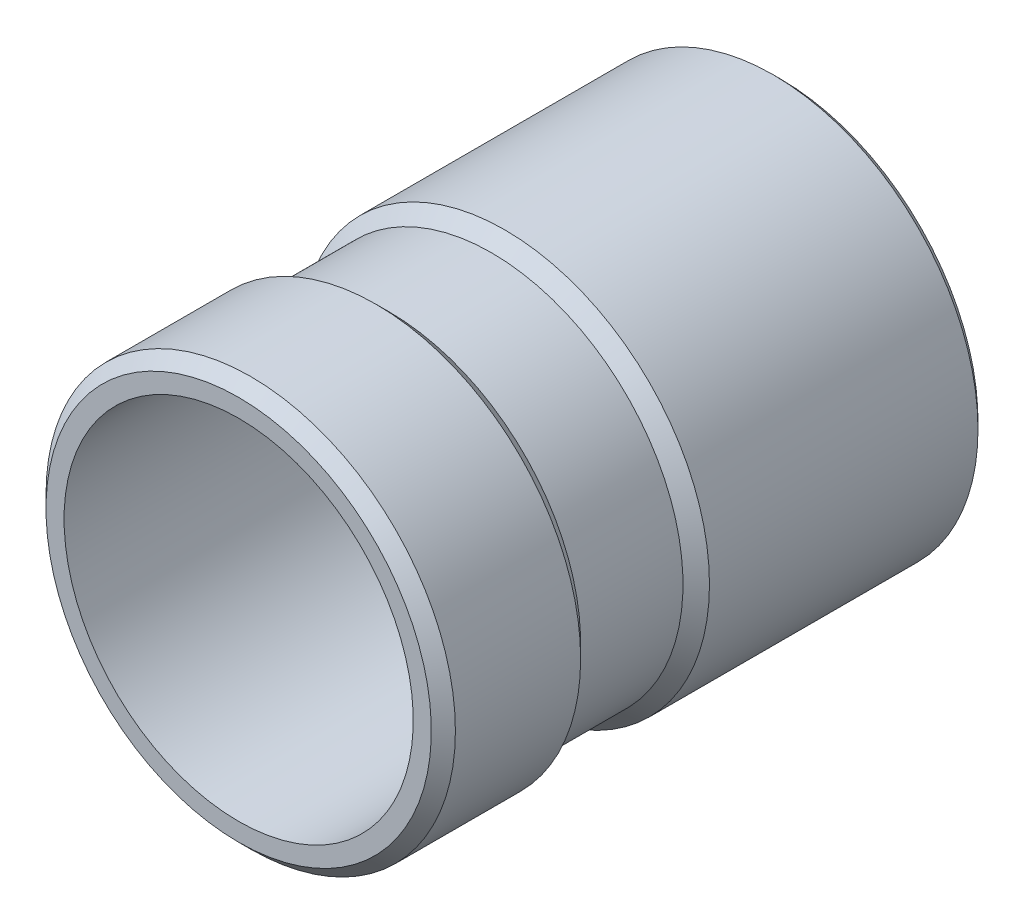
ISO-10303-21;
HEADER;
FILE_DESCRIPTION(('STEP AP214'),'2;1');
FILE_NAME('part.step','',(''),(''),'','','');
FILE_SCHEMA(('AUTOMOTIVE_DESIGN { 1 0 10303 214 1 1 1 1 }'));
ENDSEC;
DATA;
#1=APPLICATION_CONTEXT('core data for automotive mechanical design processes');
#2=APPLICATION_PROTOCOL_DEFINITION('international standard','automotive_design',2000,#1);
#3=PRODUCT_CONTEXT('',#1,'mechanical');
#4=PRODUCT('Part','Part','',(#3));
#5=PRODUCT_RELATED_PRODUCT_CATEGORY('part','',(#4));
#6=PRODUCT_DEFINITION_FORMATION('','',#4);
#7=PRODUCT_DEFINITION_CONTEXT('part definition',#1,'design');
#8=PRODUCT_DEFINITION('design','',#6,#7);
#9=PRODUCT_DEFINITION_SHAPE('','',#8);
#10=(LENGTH_UNIT() NAMED_UNIT(*) SI_UNIT(.MILLI.,.METRE.));
#11=(NAMED_UNIT(*) PLANE_ANGLE_UNIT() SI_UNIT($,.RADIAN.));
#12=(NAMED_UNIT(*) SI_UNIT($,.STERADIAN.) SOLID_ANGLE_UNIT());
#13=UNCERTAINTY_MEASURE_WITH_UNIT(LENGTH_MEASURE(1.E-05),#10,'distance_accuracy_value','');
#14=(GEOMETRIC_REPRESENTATION_CONTEXT(3) GLOBAL_UNCERTAINTY_ASSIGNED_CONTEXT((#13)) GLOBAL_UNIT_ASSIGNED_CONTEXT((#10,
#11,#12)) REPRESENTATION_CONTEXT('',''));
#15=CARTESIAN_POINT('',(0.,0.,0.));
#16=DIRECTION('',(0.,0.,1.));
#17=DIRECTION('',(1.,0.,0.));
#18=AXIS2_PLACEMENT_3D('',#15,#16,#17);
#19=CARTESIAN_POINT('',(0.,0.,0.));
#20=DIRECTION('',(0.,0.,-1.));
#21=DIRECTION('',(0.,1.,0.));
#22=AXIS2_PLACEMENT_3D('',#19,#20,#21);
#23=CYLINDRICAL_SURFACE('',#22,7.25);
#24=CARTESIAN_POINT('',(0.,0.,22.5));
#25=DIRECTION('',(0.,0.,-1.));
#26=DIRECTION('',(0.,1.,0.));
#27=AXIS2_PLACEMENT_3D('',#24,#25,#26);
#28=CIRCLE('',#27,7.25);
#29=CARTESIAN_POINT('',(0.,7.25,22.5));
#30=VERTEX_POINT('',#29);
#31=EDGE_CURVE('E44',#30,#30,#28,.T.);
#32=ORIENTED_EDGE('',*,*,#31,.F.);
#33=EDGE_LOOP('',(#32));
#34=FACE_BOUND('',#33,.T.);
#35=CARTESIAN_POINT('',(0.,0.,0.));
#36=DIRECTION('',(0.,0.,-1.));
#37=DIRECTION('',(0.,1.,0.));
#38=AXIS2_PLACEMENT_3D('',#35,#36,#37);
#39=CIRCLE('',#38,7.25);
#40=CARTESIAN_POINT('',(0.,7.25,0.));
#41=VERTEX_POINT('',#40);
#42=EDGE_CURVE('E47',#41,#41,#39,.T.);
#43=ORIENTED_EDGE('',*,*,#42,.T.);
#44=EDGE_LOOP('',(#43));
#45=FACE_BOUND('',#44,.T.);
#46=ADVANCED_FACE('F12',(#34,#45),#23,.F.);
#47=CARTESIAN_POINT('',(8.,0.,22.5));
#48=DIRECTION('',(0.,0.,1.));
#49=DIRECTION('',(0.,-1.,0.));
#50=AXIS2_PLACEMENT_3D('',#47,#48,#49);
#51=PLANE('',#50);
#52=ORIENTED_EDGE('',*,*,#31,.T.);
#53=EDGE_LOOP('',(#52));
#54=FACE_BOUND('',#53,.T.);
#55=CARTESIAN_POINT('',(0.,0.,22.5));
#56=DIRECTION('',(0.,0.,-1.));
#57=DIRECTION('',(0.,1.,0.));
#58=AXIS2_PLACEMENT_3D('',#55,#56,#57);
#59=CIRCLE('',#58,8.);
#60=CARTESIAN_POINT('',(0.,8.,22.5));
#61=VERTEX_POINT('',#60);
#62=EDGE_CURVE('E41',#61,#61,#59,.T.);
#63=ORIENTED_EDGE('',*,*,#62,.F.);
#64=EDGE_LOOP('',(#63));
#65=FACE_BOUND('',#64,.T.);
#66=ADVANCED_FACE('F61',(#54,#65),#51,.T.);
#67=CARTESIAN_POINT('',(0.,0.,22.));
#68=DIRECTION('',(0.,0.,-1.));
#69=DIRECTION('',(0.,1.,0.));
#70=AXIS2_PLACEMENT_3D('',#67,#68,#69);
#71=CONICAL_SURFACE('',#70,8.5,0.785398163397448);
#72=ORIENTED_EDGE('',*,*,#62,.T.);
#73=EDGE_LOOP('',(#72));
#74=FACE_BOUND('',#73,.T.);
#75=CARTESIAN_POINT('',(0.,0.,22.));
#76=DIRECTION('',(0.,0.,-1.));
#77=DIRECTION('',(0.,1.,0.));
#78=AXIS2_PLACEMENT_3D('',#75,#76,#77);
#79=CIRCLE('',#78,8.5);
#80=CARTESIAN_POINT('',(0.,8.5,22.));
#81=VERTEX_POINT('',#80);
#82=EDGE_CURVE('E38',#81,#81,#79,.T.);
#83=ORIENTED_EDGE('',*,*,#82,.F.);
#84=EDGE_LOOP('',(#83));
#85=FACE_BOUND('',#84,.T.);
#86=ADVANCED_FACE('F68',(#74,#85),#71,.T.);
#87=CARTESIAN_POINT('',(0.,0.,0.));
#88=DIRECTION('',(0.,0.,-1.));
#89=DIRECTION('',(0.,1.,0.));
#90=AXIS2_PLACEMENT_3D('',#87,#88,#89);
#91=CYLINDRICAL_SURFACE('',#90,8.5);
#92=ORIENTED_EDGE('',*,*,#82,.T.);
#93=EDGE_LOOP('',(#92));
#94=FACE_BOUND('',#93,.T.);
#95=CARTESIAN_POINT('',(0.,0.,16.8));
#96=DIRECTION('',(0.,0.,-1.));
#97=DIRECTION('',(0.,1.,0.));
#98=AXIS2_PLACEMENT_3D('',#95,#96,#97);
#99=CIRCLE('',#98,8.5);
#100=CARTESIAN_POINT('',(0.,8.5,16.8));
#101=VERTEX_POINT('',#100);
#102=EDGE_CURVE('E35',#101,#101,#99,.T.);
#103=ORIENTED_EDGE('',*,*,#102,.F.);
#104=EDGE_LOOP('',(#103));
#105=FACE_BOUND('',#104,.T.);
#106=ADVANCED_FACE('F75',(#94,#105),#91,.T.);
#107=CARTESIAN_POINT('',(0.,0.,16.25));
#108=DIRECTION('',(0.,0.,1.));
#109=DIRECTION('',(0.,-1.,0.));
#110=AXIS2_PLACEMENT_3D('',#107,#108,#109);
#111=CONICAL_SURFACE('',#110,7.95,0.785398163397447);
#112=ORIENTED_EDGE('',*,*,#102,.T.);
#113=EDGE_LOOP('',(#112));
#114=FACE_BOUND('',#113,.T.);
#115=CARTESIAN_POINT('',(0.,0.,16.25));
#116=DIRECTION('',(0.,0.,-1.));
#117=DIRECTION('',(0.,1.,0.));
#118=AXIS2_PLACEMENT_3D('',#115,#116,#117);
#119=CIRCLE('',#118,7.95);
#120=CARTESIAN_POINT('',(0.,7.95,16.25));
#121=VERTEX_POINT('',#120);
#122=EDGE_CURVE('E32',#121,#121,#119,.T.);
#123=ORIENTED_EDGE('',*,*,#122,.F.);
#124=EDGE_LOOP('',(#123));
#125=FACE_BOUND('',#124,.T.);
#126=ADVANCED_FACE('F79',(#114,#125),#111,.T.);
#127=CARTESIAN_POINT('',(0.,0.,0.));
#128=DIRECTION('',(0.,0.,-1.));
#129=DIRECTION('',(0.,1.,0.));
#130=AXIS2_PLACEMENT_3D('',#127,#128,#129);
#131=CYLINDRICAL_SURFACE('',#130,7.95);
#132=ORIENTED_EDGE('',*,*,#122,.T.);
#133=EDGE_LOOP('',(#132));
#134=FACE_BOUND('',#133,.T.);
#135=CARTESIAN_POINT('',(0.,0.,12.));
#136=DIRECTION('',(0.,0.,-1.));
#137=DIRECTION('',(0.,1.,0.));
#138=AXIS2_PLACEMENT_3D('',#135,#136,#137);
#139=CIRCLE('',#138,7.95);
#140=CARTESIAN_POINT('',(0.,7.95,12.));
#141=VERTEX_POINT('',#140);
#142=EDGE_CURVE('E27',#141,#141,#139,.T.);
#143=ORIENTED_EDGE('',*,*,#142,.F.);
#144=EDGE_LOOP('',(#143));
#145=FACE_BOUND('',#144,.T.);
#146=ADVANCED_FACE('F83',(#134,#145),#131,.T.);
#147=CARTESIAN_POINT('',(0.,0.,11.45));
#148=DIRECTION('',(0.,0.,-1.));
#149=DIRECTION('',(0.,1.,0.));
#150=AXIS2_PLACEMENT_3D('',#147,#148,#149);
#151=CONICAL_SURFACE('',#150,8.5,0.785398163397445);
#152=ORIENTED_EDGE('',*,*,#142,.T.);
#153=EDGE_LOOP('',(#152));
#154=FACE_BOUND('',#153,.T.);
#155=CARTESIAN_POINT('',(0.,0.,11.45));
#156=DIRECTION('',(0.,0.,-1.));
#157=DIRECTION('',(0.,1.,0.));
#158=AXIS2_PLACEMENT_3D('',#155,#156,#157);
#159=CIRCLE('',#158,8.5);
#160=CARTESIAN_POINT('',(0.,8.5,11.45));
#161=VERTEX_POINT('',#160);
#162=EDGE_CURVE('E23',#161,#161,#159,.T.);
#163=ORIENTED_EDGE('',*,*,#162,.F.);
#164=EDGE_LOOP('',(#163));
#165=FACE_BOUND('',#164,.T.);
#166=ADVANCED_FACE('F87',(#154,#165),#151,.T.);
#167=CARTESIAN_POINT('',(0.,0.,0.));
#168=DIRECTION('',(0.,0.,-1.));
#169=DIRECTION('',(0.,1.,0.));
#170=AXIS2_PLACEMENT_3D('',#167,#168,#169);
#171=CYLINDRICAL_SURFACE('',#170,8.5);
#172=ORIENTED_EDGE('',*,*,#162,.T.);
#173=EDGE_LOOP('',(#172));
#174=FACE_BOUND('',#173,.T.);
#175=CARTESIAN_POINT('',(0.,0.,0.3));
#176=DIRECTION('',(0.,0.,-1.));
#177=DIRECTION('',(0.,1.,0.));
#178=AXIS2_PLACEMENT_3D('',#175,#176,#177);
#179=CIRCLE('',#178,8.5);
#180=CARTESIAN_POINT('',(0.,8.5,0.3));
#181=VERTEX_POINT('',#180);
#182=EDGE_CURVE('E19',#181,#181,#179,.T.);
#183=ORIENTED_EDGE('',*,*,#182,.F.);
#184=EDGE_LOOP('',(#183));
#185=FACE_BOUND('',#184,.T.);
#186=ADVANCED_FACE('F59',(#174,#185),#171,.T.);
#187=CARTESIAN_POINT('',(0.,0.,0.));
#188=DIRECTION('',(0.,0.,1.));
#189=DIRECTION('',(0.,-1.,0.));
#190=AXIS2_PLACEMENT_3D('',#187,#188,#189);
#191=CONICAL_SURFACE('',#190,8.2,0.785398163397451);
#192=ORIENTED_EDGE('',*,*,#182,.T.);
#193=EDGE_LOOP('',(#192));
#194=FACE_BOUND('',#193,.T.);
#195=CARTESIAN_POINT('',(0.,0.,0.));
#196=DIRECTION('',(0.,0.,-1.));
#197=DIRECTION('',(0.,1.,0.));
#198=AXIS2_PLACEMENT_3D('',#195,#196,#197);
#199=CIRCLE('',#198,8.2);
#200=CARTESIAN_POINT('',(0.,8.2,0.));
#201=VERTEX_POINT('',#200);
#202=EDGE_CURVE('E8',#201,#201,#199,.T.);
#203=ORIENTED_EDGE('',*,*,#202,.F.);
#204=EDGE_LOOP('',(#203));
#205=FACE_BOUND('',#204,.T.);
#206=ADVANCED_FACE('F53',(#194,#205),#191,.T.);
#207=CARTESIAN_POINT('',(7.25,0.,0.));
#208=DIRECTION('',(0.,0.,-1.));
#209=DIRECTION('',(0.,1.,0.));
#210=AXIS2_PLACEMENT_3D('',#207,#208,#209);
#211=PLANE('',#210);
#212=ORIENTED_EDGE('',*,*,#202,.T.);
#213=EDGE_LOOP('',(#212));
#214=FACE_BOUND('',#213,.T.);
#215=ORIENTED_EDGE('',*,*,#42,.F.);
#216=EDGE_LOOP('',(#215));
#217=FACE_BOUND('',#216,.T.);
#218=ADVANCED_FACE('F14',(#214,#217),#211,.T.);
#219=CLOSED_SHELL('',(#46,#66,#86,#106,#126,#146,#166,#186,#206,#218));
#220=MANIFOLD_SOLID_BREP('B1',#219);
#221=ADVANCED_BREP_SHAPE_REPRESENTATION('',(#18,#220),#14);
#222=SHAPE_DEFINITION_REPRESENTATION(#9,#221);
ENDSEC;
END-ISO-10303-21;
